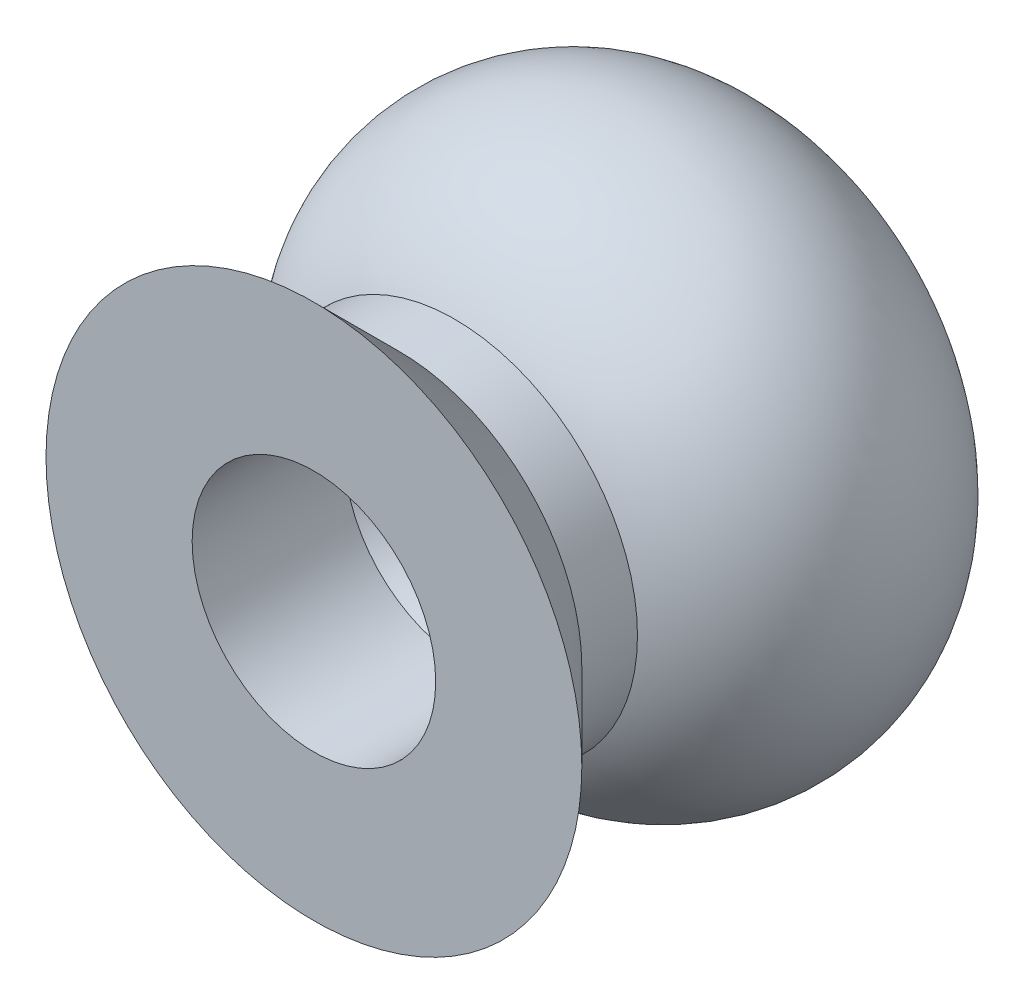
ISO-10303-21;
HEADER;
FILE_DESCRIPTION(('STEP AP214'),'2;1');
FILE_NAME('part.step','',(''),(''),'','','');
FILE_SCHEMA(('AUTOMOTIVE_DESIGN { 1 0 10303 214 1 1 1 1 }'));
ENDSEC;
DATA;
#1=APPLICATION_CONTEXT('core data for automotive mechanical design processes');
#2=APPLICATION_PROTOCOL_DEFINITION('international standard','automotive_design',2000,#1);
#3=PRODUCT_CONTEXT('',#1,'mechanical');
#4=PRODUCT('Part','Part','',(#3));
#5=PRODUCT_RELATED_PRODUCT_CATEGORY('part','',(#4));
#6=PRODUCT_DEFINITION_FORMATION('','',#4);
#7=PRODUCT_DEFINITION_CONTEXT('part definition',#1,'design');
#8=PRODUCT_DEFINITION('design','',#6,#7);
#9=PRODUCT_DEFINITION_SHAPE('','',#8);
#10=(LENGTH_UNIT() NAMED_UNIT(*) SI_UNIT(.MILLI.,.METRE.));
#11=(NAMED_UNIT(*) PLANE_ANGLE_UNIT() SI_UNIT($,.RADIAN.));
#12=(NAMED_UNIT(*) SI_UNIT($,.STERADIAN.) SOLID_ANGLE_UNIT());
#13=UNCERTAINTY_MEASURE_WITH_UNIT(LENGTH_MEASURE(1.E-05),#10,'distance_accuracy_value','');
#14=(GEOMETRIC_REPRESENTATION_CONTEXT(3) GLOBAL_UNCERTAINTY_ASSIGNED_CONTEXT((#13)) GLOBAL_UNIT_ASSIGNED_CONTEXT((#10,
#11,#12)) REPRESENTATION_CONTEXT('',''));
#15=CARTESIAN_POINT('',(0.,0.,0.));
#16=DIRECTION('',(0.,0.,1.));
#17=DIRECTION('',(1.,0.,0.));
#18=AXIS2_PLACEMENT_3D('',#15,#16,#17);
#19=CARTESIAN_POINT('',(0.,0.,0.));
#20=DIRECTION('',(0.,0.,1.));
#21=DIRECTION('',(1.,0.,0.));
#22=AXIS2_PLACEMENT_3D('',#19,#20,#21);
#23=CYLINDRICAL_SURFACE('',#22,2.);
#24=CARTESIAN_POINT('',(0.,0.,-2.5));
#25=DIRECTION('',(0.,0.,1.));
#26=DIRECTION('',(1.,0.,0.));
#27=AXIS2_PLACEMENT_3D('',#24,#25,#26);
#28=CIRCLE('',#27,2.);
#29=CARTESIAN_POINT('',(2.,0.,-2.5));
#30=VERTEX_POINT('',#29);
#31=EDGE_CURVE('E58',#30,#30,#28,.T.);
#32=ORIENTED_EDGE('',*,*,#31,.F.);
#33=EDGE_LOOP('',(#32));
#34=FACE_BOUND('',#33,.T.);
#35=CARTESIAN_POINT('',(0.,0.,0.));
#36=DIRECTION('',(0.,0.,1.));
#37=DIRECTION('',(1.,0.,0.));
#38=AXIS2_PLACEMENT_3D('',#35,#36,#37);
#39=CIRCLE('',#38,2.);
#40=CARTESIAN_POINT('',(2.,0.,0.));
#41=VERTEX_POINT('',#40);
#42=EDGE_CURVE('E10',#41,#41,#39,.T.);
#43=ORIENTED_EDGE('',*,*,#42,.T.);
#44=EDGE_LOOP('',(#43));
#45=FACE_BOUND('',#44,.T.);
#46=ADVANCED_FACE('F30',(#34,#45),#23,.F.);
#47=CARTESIAN_POINT('',(0.,2.,0.));
#48=DIRECTION('',(0.,0.,-1.));
#49=DIRECTION('',(-1.,0.,0.));
#50=AXIS2_PLACEMENT_3D('',#47,#48,#49);
#51=PLANE('',#50);
#52=ORIENTED_EDGE('',*,*,#42,.F.);
#53=EDGE_LOOP('',(#52));
#54=FACE_BOUND('',#53,.T.);
#55=CARTESIAN_POINT('',(0.,0.,0.));
#56=DIRECTION('',(0.,0.,1.));
#57=DIRECTION('',(1.,0.,0.));
#58=AXIS2_PLACEMENT_3D('',#55,#56,#57);
#59=CIRCLE('',#58,4.40000000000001);
#60=CARTESIAN_POINT('',(4.40000000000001,0.,0.));
#61=VERTEX_POINT('',#60);
#62=EDGE_CURVE('E36',#61,#61,#59,.T.);
#63=ORIENTED_EDGE('',*,*,#62,.T.);
#64=EDGE_LOOP('',(#63));
#65=FACE_BOUND('',#64,.T.);
#66=ADVANCED_FACE('F65',(#54,#65),#51,.F.);
#67=CARTESIAN_POINT('',(0.,0.,-1.4));
#68=DIRECTION('',(0.,0.,1.));
#69=DIRECTION('',(1.,0.,0.));
#70=AXIS2_PLACEMENT_3D('',#67,#68,#69);
#71=CONICAL_SURFACE('',#70,3.,0.785398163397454);
#72=ORIENTED_EDGE('',*,*,#62,.F.);
#73=EDGE_LOOP('',(#72));
#74=FACE_BOUND('',#73,.T.);
#75=CARTESIAN_POINT('',(0.,0.,-1.4));
#76=DIRECTION('',(0.,0.,1.));
#77=DIRECTION('',(1.,0.,0.));
#78=AXIS2_PLACEMENT_3D('',#75,#76,#77);
#79=CIRCLE('',#78,3.);
#80=CARTESIAN_POINT('',(3.,0.,-1.4));
#81=VERTEX_POINT('',#80);
#82=EDGE_CURVE('E40',#81,#81,#79,.T.);
#83=ORIENTED_EDGE('',*,*,#82,.T.);
#84=EDGE_LOOP('',(#83));
#85=FACE_BOUND('',#84,.T.);
#86=ADVANCED_FACE('F69',(#74,#85),#71,.T.);
#87=CARTESIAN_POINT('',(0.,0.,0.));
#88=DIRECTION('',(0.,0.,1.));
#89=DIRECTION('',(1.,0.,0.));
#90=AXIS2_PLACEMENT_3D('',#87,#88,#89);
#91=CYLINDRICAL_SURFACE('',#90,3.);
#92=ORIENTED_EDGE('',*,*,#82,.F.);
#93=EDGE_LOOP('',(#92));
#94=FACE_BOUND('',#93,.T.);
#95=CARTESIAN_POINT('',(0.,0.,-2.31378645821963));
#96=DIRECTION('',(0.,0.,1.));
#97=DIRECTION('',(1.,0.,0.));
#98=AXIS2_PLACEMENT_3D('',#95,#96,#97);
#99=CIRCLE('',#98,3.);
#100=CARTESIAN_POINT('',(3.,0.,-2.31378645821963));
#101=VERTEX_POINT('',#100);
#102=EDGE_CURVE('E44',#101,#101,#99,.T.);
#103=ORIENTED_EDGE('',*,*,#102,.T.);
#104=EDGE_LOOP('',(#103));
#105=FACE_BOUND('',#104,.T.);
#106=ADVANCED_FACE('F74',(#94,#105),#91,.T.);
#107=CARTESIAN_POINT('',(0.,0.,-5.));
#108=DIRECTION('',(0.,0.,1.));
#109=DIRECTION('',(1.,0.,0.));
#110=AXIS2_PLACEMENT_3D('',#107,#108,#109);
#111=DEGENERATE_TOROIDAL_SURFACE('',#110,1.66423924,3.,.T.);
#112=ORIENTED_EDGE('',*,*,#102,.F.);
#113=EDGE_LOOP('',(#112));
#114=FACE_BOUND('',#113,.T.);
#115=CARTESIAN_POINT('',(0.,0.,-8.));
#116=DIRECTION('',(0.,0.,1.));
#117=DIRECTION('',(1.,0.,0.));
#118=AXIS2_PLACEMENT_3D('',#115,#116,#117);
#119=CIRCLE('',#118,1.66423924);
#120=CARTESIAN_POINT('',(1.66423924,0.,-8.));
#121=VERTEX_POINT('',#120);
#122=EDGE_CURVE('E49',#121,#121,#119,.T.);
#123=ORIENTED_EDGE('',*,*,#122,.T.);
#124=EDGE_LOOP('',(#123));
#125=FACE_BOUND('',#124,.T.);
#126=ADVANCED_FACE('F80',(#114,#125),#111,.T.);
#127=CARTESIAN_POINT('',(0.,1.65,-8.));
#128=DIRECTION('',(0.,0.,1.));
#129=DIRECTION('',(1.,0.,0.));
#130=AXIS2_PLACEMENT_3D('',#127,#128,#129);
#131=PLANE('',#130);
#132=ORIENTED_EDGE('',*,*,#122,.F.);
#133=EDGE_LOOP('',(#132));
#134=FACE_BOUND('',#133,.T.);
#135=CARTESIAN_POINT('',(0.,0.,-8.));
#136=DIRECTION('',(0.,0.,1.));
#137=DIRECTION('',(1.,0.,0.));
#138=AXIS2_PLACEMENT_3D('',#135,#136,#137);
#139=CIRCLE('',#138,1.65);
#140=CARTESIAN_POINT('',(1.65,0.,-8.));
#141=VERTEX_POINT('',#140);
#142=EDGE_CURVE('E52',#141,#141,#139,.T.);
#143=ORIENTED_EDGE('',*,*,#142,.T.);
#144=EDGE_LOOP('',(#143));
#145=FACE_BOUND('',#144,.T.);
#146=ADVANCED_FACE('F84',(#134,#145),#131,.F.);
#147=CARTESIAN_POINT('',(0.,0.,0.));
#148=DIRECTION('',(0.,0.,1.));
#149=DIRECTION('',(1.,0.,0.));
#150=AXIS2_PLACEMENT_3D('',#147,#148,#149);
#151=CYLINDRICAL_SURFACE('',#150,1.65);
#152=ORIENTED_EDGE('',*,*,#142,.F.);
#153=EDGE_LOOP('',(#152));
#154=FACE_BOUND('',#153,.T.);
#155=CARTESIAN_POINT('',(0.,0.,-3.10621778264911));
#156=DIRECTION('',(0.,0.,1.));
#157=DIRECTION('',(1.,0.,0.));
#158=AXIS2_PLACEMENT_3D('',#155,#156,#157);
#159=CIRCLE('',#158,1.65);
#160=CARTESIAN_POINT('',(1.65,0.,-3.10621778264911));
#161=VERTEX_POINT('',#160);
#162=EDGE_CURVE('E55',#161,#161,#159,.T.);
#163=ORIENTED_EDGE('',*,*,#162,.T.);
#164=EDGE_LOOP('',(#163));
#165=FACE_BOUND('',#164,.T.);
#166=ADVANCED_FACE('F88',(#154,#165),#151,.F.);
#167=CARTESIAN_POINT('',(0.,0.,-2.5));
#168=DIRECTION('',(0.,0.,1.));
#169=DIRECTION('',(1.,0.,0.));
#170=AXIS2_PLACEMENT_3D('',#167,#168,#169);
#171=CONICAL_SURFACE('',#170,2.,0.5235987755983);
#172=ORIENTED_EDGE('',*,*,#162,.F.);
#173=EDGE_LOOP('',(#172));
#174=FACE_BOUND('',#173,.T.);
#175=ORIENTED_EDGE('',*,*,#31,.T.);
#176=EDGE_LOOP('',(#175));
#177=FACE_BOUND('',#176,.T.);
#178=ADVANCED_FACE('F62',(#174,#177),#171,.F.);
#179=CLOSED_SHELL('',(#46,#66,#86,#106,#126,#146,#166,#178));
#180=MANIFOLD_SOLID_BREP('B2',#179);
#181=ADVANCED_BREP_SHAPE_REPRESENTATION('',(#18,#180),#14);
#182=SHAPE_DEFINITION_REPRESENTATION(#9,#181);
ENDSEC;
END-ISO-10303-21;
